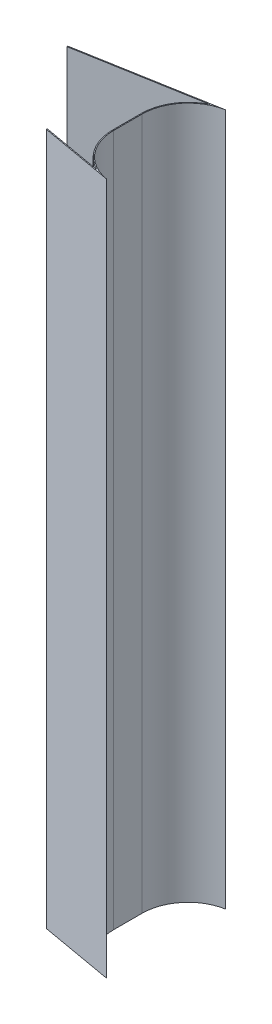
ISO-10303-21;
HEADER;
FILE_DESCRIPTION(('STEP AP214'),'2;1');
FILE_NAME('part.step','',(''),(''),'','','');
FILE_SCHEMA(('AUTOMOTIVE_DESIGN { 1 0 10303 214 1 1 1 1 }'));
ENDSEC;
DATA;
#1=APPLICATION_CONTEXT('core data for automotive mechanical design processes');
#2=APPLICATION_PROTOCOL_DEFINITION('international standard','automotive_design',2000,#1);
#3=PRODUCT_CONTEXT('',#1,'mechanical');
#4=PRODUCT('Part','Part','',(#3));
#5=PRODUCT_RELATED_PRODUCT_CATEGORY('part','',(#4));
#6=PRODUCT_DEFINITION_FORMATION('','',#4);
#7=PRODUCT_DEFINITION_CONTEXT('part definition',#1,'design');
#8=PRODUCT_DEFINITION('design','',#6,#7);
#9=PRODUCT_DEFINITION_SHAPE('','',#8);
#10=(LENGTH_UNIT() NAMED_UNIT(*) SI_UNIT(.MILLI.,.METRE.));
#11=(NAMED_UNIT(*) PLANE_ANGLE_UNIT() SI_UNIT($,.RADIAN.));
#12=(NAMED_UNIT(*) SI_UNIT($,.STERADIAN.) SOLID_ANGLE_UNIT());
#13=UNCERTAINTY_MEASURE_WITH_UNIT(LENGTH_MEASURE(1.E-05),#10,'distance_accuracy_value','');
#14=(GEOMETRIC_REPRESENTATION_CONTEXT(3) GLOBAL_UNCERTAINTY_ASSIGNED_CONTEXT((#13)) GLOBAL_UNIT_ASSIGNED_CONTEXT((#10,
#11,#12)) REPRESENTATION_CONTEXT('',''));
#15=CARTESIAN_POINT('',(0.,0.,0.));
#16=DIRECTION('',(0.,0.,1.));
#17=DIRECTION('',(1.,0.,0.));
#18=AXIS2_PLACEMENT_3D('',#15,#16,#17);
#19=CARTESIAN_POINT('',(-83.0844841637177,762.,50.2758972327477));
#20=DIRECTION('',(0.984807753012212,0.,0.173648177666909));
#21=DIRECTION('',(0.173648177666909,0.,-0.984807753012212));
#22=AXIS2_PLACEMENT_3D('',#19,#20,#21);
#23=PLANE('',#22);
#24=DIRECTION('',(-0.173648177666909,0.,0.984807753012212));
#25=VECTOR('',#24,1.);
#26=CARTESIAN_POINT('',(-83.0844841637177,0.,50.2758972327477));
#27=LINE('',#26,#25);
#28=CARTESIAN_POINT('',(-82.9080576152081,0.,49.2753325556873));
#29=VERTEX_POINT('',#28);
#30=CARTESIAN_POINT('',(-83.0844841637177,0.,50.2758972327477));
#31=VERTEX_POINT('',#30);
#32=EDGE_CURVE('E154',#29,#31,#27,.T.);
#33=ORIENTED_EDGE('',*,*,#32,.T.);
#34=DIRECTION('',(0.,-1.,0.));
#35=VECTOR('',#34,1.);
#36=CARTESIAN_POINT('',(-83.0844841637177,762.,50.2758972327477));
#37=LINE('',#36,#35);
#38=CARTESIAN_POINT('',(-83.0844841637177,762.,50.2758972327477));
#39=VERTEX_POINT('',#38);
#40=EDGE_CURVE('E11',#39,#31,#37,.T.);
#41=ORIENTED_EDGE('',*,*,#40,.F.);
#42=DIRECTION('',(-0.173648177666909,0.,0.984807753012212));
#43=VECTOR('',#42,1.);
#44=CARTESIAN_POINT('',(-83.0844841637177,762.,50.2758972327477));
#45=LINE('',#44,#43);
#46=CARTESIAN_POINT('',(-82.9080576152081,762.,49.2753325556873));
#47=VERTEX_POINT('',#46);
#48=EDGE_CURVE('E176',#47,#39,#45,.T.);
#49=ORIENTED_EDGE('',*,*,#48,.F.);
#50=DIRECTION('',(0.,-1.,0.));
#51=VECTOR('',#50,1.);
#52=CARTESIAN_POINT('',(-82.9080576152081,762.,49.2753325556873));
#53=LINE('',#52,#51);
#54=EDGE_CURVE('E150',#47,#29,#53,.T.);
#55=ORIENTED_EDGE('',*,*,#54,.T.);
#56=EDGE_LOOP('',(#33,#41,#49,#55));
#57=FACE_BOUND('',#56,.T.);
#58=ADVANCED_FACE('F34',(#57),#23,.F.);
#59=CARTESIAN_POINT('',(-83.0844841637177,762.,50.2758972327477));
#60=DIRECTION('',(0.173648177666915,0.,-0.984807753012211));
#61=DIRECTION('',(-0.984807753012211,0.,-0.173648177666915));
#62=AXIS2_PLACEMENT_3D('',#59,#60,#61);
#63=PLANE('',#62);
#64=DIRECTION('',(0.984807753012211,0.,0.173648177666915));
#65=VECTOR('',#64,1.);
#66=CARTESIAN_POINT('',(-83.0844841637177,0.,50.2758972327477));
#67=LINE('',#66,#65);
#68=CARTESIAN_POINT('',(-3.00472742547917,0.,64.3961189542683));
#69=VERTEX_POINT('',#68);
#70=EDGE_CURVE('E157',#31,#69,#67,.T.);
#71=ORIENTED_EDGE('',*,*,#70,.T.);
#72=DIRECTION('',(0.,-1.,0.));
#73=VECTOR('',#72,1.);
#74=CARTESIAN_POINT('',(-3.00472742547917,762.,64.3961189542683));
#75=LINE('',#74,#73);
#76=CARTESIAN_POINT('',(-3.00472742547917,762.,64.3961189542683));
#77=VERTEX_POINT('',#76);
#78=EDGE_CURVE('E42',#77,#69,#75,.T.);
#79=ORIENTED_EDGE('',*,*,#78,.F.);
#80=DIRECTION('',(0.984807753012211,0.,0.173648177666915));
#81=VECTOR('',#80,1.);
#82=CARTESIAN_POINT('',(-83.0844841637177,762.,50.2758972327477));
#83=LINE('',#82,#81);
#84=EDGE_CURVE('E105',#39,#77,#83,.T.);
#85=ORIENTED_EDGE('',*,*,#84,.F.);
#86=ORIENTED_EDGE('',*,*,#40,.T.);
#87=EDGE_LOOP('',(#71,#79,#85,#86));
#88=FACE_BOUND('',#87,.T.);
#89=ADVANCED_FACE('F254',(#88),#63,.F.);
#90=CARTESIAN_POINT('',(5.81659999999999,762.,14.367885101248));
#91=DIRECTION('',(0.,-1.,0.));
#92=DIRECTION('',(0.,0.,-1.));
#93=AXIS2_PLACEMENT_3D('',#90,#91,#92);
#94=CYLINDRICAL_SURFACE('',#93,50.8);
#95=CARTESIAN_POINT('',(5.81659999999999,0.,14.367885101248));
#96=DIRECTION('',(0.,-1.,0.));
#97=DIRECTION('',(0.,0.,-1.));
#98=AXIS2_PLACEMENT_3D('',#95,#96,#97);
#99=CIRCLE('',#98,50.8);
#100=CARTESIAN_POINT('',(-44.9834,0.,14.367885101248));
#101=VERTEX_POINT('',#100);
#102=EDGE_CURVE('E159',#69,#101,#99,.T.);
#103=ORIENTED_EDGE('',*,*,#102,.T.);
#104=DIRECTION('',(0.,-1.,0.));
#105=VECTOR('',#104,1.);
#106=CARTESIAN_POINT('',(-44.9834,762.,14.367885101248));
#107=LINE('',#106,#105);
#108=CARTESIAN_POINT('',(-44.9834,762.,14.367885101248));
#109=VERTEX_POINT('',#108);
#110=EDGE_CURVE('E195',#109,#101,#107,.T.);
#111=ORIENTED_EDGE('',*,*,#110,.F.);
#112=CARTESIAN_POINT('',(5.81659999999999,762.,14.367885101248));
#113=DIRECTION('',(0.,-1.,0.));
#114=DIRECTION('',(0.,0.,-1.));
#115=AXIS2_PLACEMENT_3D('',#112,#113,#114);
#116=CIRCLE('',#115,50.8);
#117=EDGE_CURVE('E203',#77,#109,#116,.T.);
#118=ORIENTED_EDGE('',*,*,#117,.F.);
#119=ORIENTED_EDGE('',*,*,#78,.T.);
#120=EDGE_LOOP('',(#103,#111,#118,#119));
#121=FACE_BOUND('',#120,.T.);
#122=ADVANCED_FACE('F201',(#121),#94,.F.);
#123=CARTESIAN_POINT('',(-44.9834,762.,14.367885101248));
#124=DIRECTION('',(-1.,0.,0.));
#125=DIRECTION('',(0.,0.,1.));
#126=AXIS2_PLACEMENT_3D('',#123,#124,#125);
#127=PLANE('',#126);
#128=DIRECTION('',(0.,0.,-1.));
#129=VECTOR('',#128,1.);
#130=CARTESIAN_POINT('',(-44.9834,0.,14.367885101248));
#131=LINE('',#130,#129);
#132=CARTESIAN_POINT('',(-44.9834,0.,-16.9468876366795));
#133=VERTEX_POINT('',#132);
#134=EDGE_CURVE('E161',#101,#133,#131,.T.);
#135=ORIENTED_EDGE('',*,*,#134,.T.);
#136=DIRECTION('',(0.,-1.,0.));
#137=VECTOR('',#136,1.);
#138=CARTESIAN_POINT('',(-44.9834,762.,-16.9468876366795));
#139=LINE('',#138,#137);
#140=CARTESIAN_POINT('',(-44.9834,762.,-16.9468876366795));
#141=VERTEX_POINT('',#140);
#142=EDGE_CURVE('E192',#141,#133,#139,.T.);
#143=ORIENTED_EDGE('',*,*,#142,.F.);
#144=DIRECTION('',(0.,0.,-1.));
#145=VECTOR('',#144,1.);
#146=CARTESIAN_POINT('',(-44.9834,762.,14.367885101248));
#147=LINE('',#146,#145);
#148=EDGE_CURVE('E221',#109,#141,#147,.T.);
#149=ORIENTED_EDGE('',*,*,#148,.F.);
#150=ORIENTED_EDGE('',*,*,#110,.T.);
#151=EDGE_LOOP('',(#135,#143,#149,#150));
#152=FACE_BOUND('',#151,.T.);
#153=ADVANCED_FACE('F212',(#152),#127,.F.);
#154=CARTESIAN_POINT('',(5.81659999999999,762.,-16.9468876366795));
#155=DIRECTION('',(0.,-1.,0.));
#156=DIRECTION('',(0.,0.,-1.));
#157=AXIS2_PLACEMENT_3D('',#154,#155,#156);
#158=CYLINDRICAL_SURFACE('',#157,50.8);
#159=CARTESIAN_POINT('',(5.81659999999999,0.,-16.9468876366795));
#160=DIRECTION('',(0.,-1.,0.));
#161=DIRECTION('',(0.,0.,-1.));
#162=AXIS2_PLACEMENT_3D('',#159,#160,#161);
#163=CIRCLE('',#162,50.8);
#164=CARTESIAN_POINT('',(-3.00472742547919,0.,-66.9751214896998));
#165=VERTEX_POINT('',#164);
#166=EDGE_CURVE('E163',#133,#165,#163,.T.);
#167=ORIENTED_EDGE('',*,*,#166,.T.);
#168=DIRECTION('',(0.,-1.,0.));
#169=VECTOR('',#168,1.);
#170=CARTESIAN_POINT('',(-3.00472742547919,762.,-66.9751214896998));
#171=LINE('',#170,#169);
#172=CARTESIAN_POINT('',(-3.00472742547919,762.,-66.9751214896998));
#173=VERTEX_POINT('',#172);
#174=EDGE_CURVE('E189',#173,#165,#171,.T.);
#175=ORIENTED_EDGE('',*,*,#174,.F.);
#176=CARTESIAN_POINT('',(5.81659999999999,762.,-16.9468876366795));
#177=DIRECTION('',(0.,-1.,0.));
#178=DIRECTION('',(0.,0.,-1.));
#179=AXIS2_PLACEMENT_3D('',#176,#177,#178);
#180=CIRCLE('',#179,50.8);
#181=EDGE_CURVE('E218',#141,#173,#180,.T.);
#182=ORIENTED_EDGE('',*,*,#181,.F.);
#183=ORIENTED_EDGE('',*,*,#142,.T.);
#184=EDGE_LOOP('',(#167,#175,#182,#183));
#185=FACE_BOUND('',#184,.T.);
#186=ADVANCED_FACE('F216',(#185),#158,.F.);
#187=CARTESIAN_POINT('',(-3.00472742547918,762.,-66.9751214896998));
#188=DIRECTION('',(0.173648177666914,0.,0.984807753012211));
#189=DIRECTION('',(0.984807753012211,0.,-0.173648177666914));
#190=AXIS2_PLACEMENT_3D('',#187,#188,#189);
#191=PLANE('',#190);
#192=DIRECTION('',(-0.984807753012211,0.,0.173648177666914));
#193=VECTOR('',#192,1.);
#194=CARTESIAN_POINT('',(-3.00472742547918,0.,-66.9751214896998));
#195=LINE('',#194,#193);
#196=CARTESIAN_POINT('',(-150.87680958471,0.,-40.9012837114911));
#197=VERTEX_POINT('',#196);
#198=EDGE_CURVE('E165',#165,#197,#195,.T.);
#199=ORIENTED_EDGE('',*,*,#198,.T.);
#200=DIRECTION('',(0.,-1.,0.));
#201=VECTOR('',#200,1.);
#202=CARTESIAN_POINT('',(-150.87680958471,762.,-40.9012837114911));
#203=LINE('',#202,#201);
#204=CARTESIAN_POINT('',(-150.87680958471,762.,-40.9012837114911));
#205=VERTEX_POINT('',#204);
#206=EDGE_CURVE('E186',#205,#197,#203,.T.);
#207=ORIENTED_EDGE('',*,*,#206,.F.);
#208=DIRECTION('',(-0.984807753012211,0.,0.173648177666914));
#209=VECTOR('',#208,1.);
#210=CARTESIAN_POINT('',(-3.00472742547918,762.,-66.9751214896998));
#211=LINE('',#210,#209);
#212=EDGE_CURVE('E220',#173,#205,#211,.T.);
#213=ORIENTED_EDGE('',*,*,#212,.F.);
#214=ORIENTED_EDGE('',*,*,#174,.T.);
#215=EDGE_LOOP('',(#199,#207,#213,#214));
#216=FACE_BOUND('',#215,.T.);
#217=ADVANCED_FACE('F267',(#216),#191,.F.);
#218=CARTESIAN_POINT('',(-150.700383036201,762.,-39.9007190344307));
#219=DIRECTION('',(0.984807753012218,0.,-0.173648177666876));
#220=DIRECTION('',(-0.173648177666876,0.,-0.984807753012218));
#221=AXIS2_PLACEMENT_3D('',#218,#219,#220);
#222=PLANE('',#221);
#223=DIRECTION('',(0.173648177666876,0.,0.984807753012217));
#224=VECTOR('',#223,1.);
#225=CARTESIAN_POINT('',(-150.700383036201,0.,-39.9007190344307));
#226=LINE('',#225,#224);
#227=CARTESIAN_POINT('',(-150.700383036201,0.,-39.9007190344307));
#228=VERTEX_POINT('',#227);
#229=EDGE_CURVE('E167',#197,#228,#226,.T.);
#230=ORIENTED_EDGE('',*,*,#229,.T.);
#231=DIRECTION('',(0.,-1.,0.));
#232=VECTOR('',#231,1.);
#233=CARTESIAN_POINT('',(-150.700383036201,762.,-39.9007190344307));
#234=LINE('',#233,#232);
#235=CARTESIAN_POINT('',(-150.700383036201,762.,-39.9007190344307));
#236=VERTEX_POINT('',#235);
#237=EDGE_CURVE('E183',#236,#228,#234,.T.);
#238=ORIENTED_EDGE('',*,*,#237,.F.);
#239=DIRECTION('',(0.173648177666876,0.,0.984807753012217));
#240=VECTOR('',#239,1.);
#241=CARTESIAN_POINT('',(-150.700383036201,762.,-39.9007190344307));
#242=LINE('',#241,#240);
#243=EDGE_CURVE('E223',#205,#236,#242,.T.);
#244=ORIENTED_EDGE('',*,*,#243,.F.);
#245=ORIENTED_EDGE('',*,*,#206,.T.);
#246=EDGE_LOOP('',(#230,#238,#244,#245));
#247=FACE_BOUND('',#246,.T.);
#248=ADVANCED_FACE('F270',(#247),#222,.F.);
#249=CARTESIAN_POINT('',(-16.9784222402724,762.,-63.4795086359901));
#250=DIRECTION('',(-0.173648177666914,0.,-0.984807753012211));
#251=DIRECTION('',(-0.984807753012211,0.,0.173648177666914));
#252=AXIS2_PLACEMENT_3D('',#249,#250,#251);
#253=PLANE('',#252);
#254=DIRECTION('',(0.984807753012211,0.,-0.173648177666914));
#255=VECTOR('',#254,1.);
#256=CARTESIAN_POINT('',(-16.9784222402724,0.,-63.4795086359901));
#257=LINE('',#256,#255);
#258=CARTESIAN_POINT('',(-16.9784222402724,0.,-63.4795086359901));
#259=VERTEX_POINT('',#258);
#260=EDGE_CURVE('E169',#228,#259,#257,.T.);
#261=ORIENTED_EDGE('',*,*,#260,.T.);
#262=DIRECTION('',(0.,-1.,0.));
#263=VECTOR('',#262,1.);
#264=CARTESIAN_POINT('',(-16.9784222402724,762.,-63.4795086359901));
#265=LINE('',#264,#263);
#266=CARTESIAN_POINT('',(-16.9784222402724,762.,-63.4795086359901));
#267=VERTEX_POINT('',#266);
#268=EDGE_CURVE('E180',#267,#259,#265,.T.);
#269=ORIENTED_EDGE('',*,*,#268,.F.);
#270=DIRECTION('',(0.984807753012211,0.,-0.173648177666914));
#271=VECTOR('',#270,1.);
#272=CARTESIAN_POINT('',(-16.9784222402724,762.,-63.4795086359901));
#273=LINE('',#272,#271);
#274=EDGE_CURVE('E229',#236,#267,#273,.T.);
#275=ORIENTED_EDGE('',*,*,#274,.F.);
#276=ORIENTED_EDGE('',*,*,#237,.T.);
#277=EDGE_LOOP('',(#261,#269,#275,#276));
#278=FACE_BOUND('',#277,.T.);
#279=ADVANCED_FACE('F235',(#278),#253,.F.);
#280=CARTESIAN_POINT('',(5.81659999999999,762.,-16.9468876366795));
#281=DIRECTION('',(0.,-1.,0.));
#282=DIRECTION('',(0.,0.,-1.));
#283=AXIS2_PLACEMENT_3D('',#280,#281,#282);
#284=CYLINDRICAL_SURFACE('',#283,51.816);
#285=CARTESIAN_POINT('',(5.81659999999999,0.,-16.9468876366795));
#286=DIRECTION('',(0.,1.,0.));
#287=DIRECTION('',(0.,0.,-1.));
#288=AXIS2_PLACEMENT_3D('',#285,#286,#287);
#289=CIRCLE('',#288,51.816);
#290=CARTESIAN_POINT('',(-45.9994,0.,-16.9468876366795));
#291=VERTEX_POINT('',#290);
#292=EDGE_CURVE('E171',#259,#291,#289,.T.);
#293=ORIENTED_EDGE('',*,*,#292,.T.);
#294=DIRECTION('',(0.,-1.,0.));
#295=VECTOR('',#294,1.);
#296=CARTESIAN_POINT('',(-45.9994,762.,-16.9468876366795));
#297=LINE('',#296,#295);
#298=CARTESIAN_POINT('',(-45.9994,762.,-16.9468876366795));
#299=VERTEX_POINT('',#298);
#300=EDGE_CURVE('E145',#299,#291,#297,.T.);
#301=ORIENTED_EDGE('',*,*,#300,.F.);
#302=CARTESIAN_POINT('',(5.81659999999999,762.,-16.9468876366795));
#303=DIRECTION('',(0.,1.,0.));
#304=DIRECTION('',(0.,0.,-1.));
#305=AXIS2_PLACEMENT_3D('',#302,#303,#304);
#306=CIRCLE('',#305,51.816);
#307=EDGE_CURVE('E136',#267,#299,#306,.T.);
#308=ORIENTED_EDGE('',*,*,#307,.F.);
#309=ORIENTED_EDGE('',*,*,#268,.T.);
#310=EDGE_LOOP('',(#293,#301,#308,#309));
#311=FACE_BOUND('',#310,.T.);
#312=ADVANCED_FACE('F239',(#311),#284,.T.);
#313=CARTESIAN_POINT('',(-45.9994,762.,14.367885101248));
#314=DIRECTION('',(1.,0.,0.));
#315=DIRECTION('',(0.,0.,-1.));
#316=AXIS2_PLACEMENT_3D('',#313,#314,#315);
#317=PLANE('',#316);
#318=DIRECTION('',(0.,0.,1.));
#319=VECTOR('',#318,1.);
#320=CARTESIAN_POINT('',(-45.9994,0.,14.367885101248));
#321=LINE('',#320,#319);
#322=CARTESIAN_POINT('',(-45.9994,0.,14.367885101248));
#323=VERTEX_POINT('',#322);
#324=EDGE_CURVE('E144',#291,#323,#321,.T.);
#325=ORIENTED_EDGE('',*,*,#324,.T.);
#326=DIRECTION('',(0.,-1.,0.));
#327=VECTOR('',#326,1.);
#328=CARTESIAN_POINT('',(-45.9994,762.,14.367885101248));
#329=LINE('',#328,#327);
#330=CARTESIAN_POINT('',(-45.9994,762.,14.367885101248));
#331=VERTEX_POINT('',#330);
#332=EDGE_CURVE('E141',#331,#323,#329,.T.);
#333=ORIENTED_EDGE('',*,*,#332,.F.);
#334=DIRECTION('',(0.,0.,1.));
#335=VECTOR('',#334,1.);
#336=CARTESIAN_POINT('',(-45.9994,762.,14.367885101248));
#337=LINE('',#336,#335);
#338=EDGE_CURVE('E130',#299,#331,#337,.T.);
#339=ORIENTED_EDGE('',*,*,#338,.F.);
#340=ORIENTED_EDGE('',*,*,#300,.T.);
#341=EDGE_LOOP('',(#325,#333,#339,#340));
#342=FACE_BOUND('',#341,.T.);
#343=ADVANCED_FACE('F142',(#342),#317,.F.);
#344=CARTESIAN_POINT('',(5.81659999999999,762.,14.367885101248));
#345=DIRECTION('',(0.,-1.,0.));
#346=DIRECTION('',(0.,0.,-1.));
#347=AXIS2_PLACEMENT_3D('',#344,#345,#346);
#348=CYLINDRICAL_SURFACE('',#347,51.816);
#349=CARTESIAN_POINT('',(5.81659999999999,0.,14.367885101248));
#350=DIRECTION('',(0.,1.,0.));
#351=DIRECTION('',(0.,0.,-1.));
#352=AXIS2_PLACEMENT_3D('',#349,#350,#351);
#353=CIRCLE('',#352,51.816);
#354=CARTESIAN_POINT('',(-16.9784222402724,0.,60.9005061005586));
#355=VERTEX_POINT('',#354);
#356=EDGE_CURVE('E91',#323,#355,#353,.T.);
#357=ORIENTED_EDGE('',*,*,#356,.T.);
#358=DIRECTION('',(0.,-1.,0.));
#359=VECTOR('',#358,1.);
#360=CARTESIAN_POINT('',(-16.9784222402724,762.,60.9005061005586));
#361=LINE('',#360,#359);
#362=CARTESIAN_POINT('',(-16.9784222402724,762.,60.9005061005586));
#363=VERTEX_POINT('',#362);
#364=EDGE_CURVE('E146',#363,#355,#361,.T.);
#365=ORIENTED_EDGE('',*,*,#364,.F.);
#366=CARTESIAN_POINT('',(5.81659999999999,762.,14.367885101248));
#367=DIRECTION('',(0.,1.,0.));
#368=DIRECTION('',(0.,0.,-1.));
#369=AXIS2_PLACEMENT_3D('',#366,#367,#368);
#370=CIRCLE('',#369,51.816);
#371=EDGE_CURVE('E134',#331,#363,#370,.T.);
#372=ORIENTED_EDGE('',*,*,#371,.F.);
#373=ORIENTED_EDGE('',*,*,#332,.T.);
#374=EDGE_LOOP('',(#357,#365,#372,#373));
#375=FACE_BOUND('',#374,.T.);
#376=ADVANCED_FACE('F148',(#375),#348,.T.);
#377=CARTESIAN_POINT('',(-82.9080576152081,762.,49.2753325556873));
#378=DIRECTION('',(-0.173648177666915,0.,0.984807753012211));
#379=DIRECTION('',(0.984807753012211,0.,0.173648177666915));
#380=AXIS2_PLACEMENT_3D('',#377,#378,#379);
#381=PLANE('',#380);
#382=DIRECTION('',(-0.984807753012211,0.,-0.173648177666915));
#383=VECTOR('',#382,1.);
#384=CARTESIAN_POINT('',(-82.9080576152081,0.,49.2753325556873));
#385=LINE('',#384,#383);
#386=EDGE_CURVE('E97',#355,#29,#385,.T.);
#387=ORIENTED_EDGE('',*,*,#386,.T.);
#388=ORIENTED_EDGE('',*,*,#54,.F.);
#389=DIRECTION('',(-0.984807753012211,0.,-0.173648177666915));
#390=VECTOR('',#389,1.);
#391=CARTESIAN_POINT('',(-82.9080576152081,762.,49.2753325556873));
#392=LINE('',#391,#390);
#393=EDGE_CURVE('E50',#363,#47,#392,.T.);
#394=ORIENTED_EDGE('',*,*,#393,.F.);
#395=ORIENTED_EDGE('',*,*,#364,.T.);
#396=EDGE_LOOP('',(#387,#388,#394,#395));
#397=FACE_BOUND('',#396,.T.);
#398=ADVANCED_FACE('F243',(#397),#381,.F.);
#399=CARTESIAN_POINT('',(5.81659999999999,762.,14.367885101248));
#400=DIRECTION('',(0.,-1.,0.));
#401=DIRECTION('',(0.,0.,-1.));
#402=AXIS2_PLACEMENT_3D('',#399,#400,#401);
#403=PLANE('',#402);
#404=ORIENTED_EDGE('',*,*,#48,.T.);
#405=ORIENTED_EDGE('',*,*,#84,.T.);
#406=ORIENTED_EDGE('',*,*,#117,.T.);
#407=ORIENTED_EDGE('',*,*,#148,.T.);
#408=ORIENTED_EDGE('',*,*,#181,.T.);
#409=ORIENTED_EDGE('',*,*,#212,.T.);
#410=ORIENTED_EDGE('',*,*,#243,.T.);
#411=ORIENTED_EDGE('',*,*,#274,.T.);
#412=ORIENTED_EDGE('',*,*,#307,.T.);
#413=ORIENTED_EDGE('',*,*,#338,.T.);
#414=ORIENTED_EDGE('',*,*,#371,.T.);
#415=ORIENTED_EDGE('',*,*,#393,.T.);
#416=EDGE_LOOP('',(#404,#405,#406,#407,#408,#409,#410,#411,#412,#413,#414,#415));
#417=FACE_BOUND('',#416,.T.);
#418=ADVANCED_FACE('F132',(#417),#403,.F.);
#419=CARTESIAN_POINT('',(5.81659999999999,0.,14.367885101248));
#420=DIRECTION('',(0.,-1.,0.));
#421=DIRECTION('',(0.,0.,-1.));
#422=AXIS2_PLACEMENT_3D('',#419,#420,#421);
#423=PLANE('',#422);
#424=ORIENTED_EDGE('',*,*,#32,.F.);
#425=ORIENTED_EDGE('',*,*,#386,.F.);
#426=ORIENTED_EDGE('',*,*,#356,.F.);
#427=ORIENTED_EDGE('',*,*,#324,.F.);
#428=ORIENTED_EDGE('',*,*,#292,.F.);
#429=ORIENTED_EDGE('',*,*,#260,.F.);
#430=ORIENTED_EDGE('',*,*,#229,.F.);
#431=ORIENTED_EDGE('',*,*,#198,.F.);
#432=ORIENTED_EDGE('',*,*,#166,.F.);
#433=ORIENTED_EDGE('',*,*,#134,.F.);
#434=ORIENTED_EDGE('',*,*,#102,.F.);
#435=ORIENTED_EDGE('',*,*,#70,.F.);
#436=EDGE_LOOP('',(#424,#425,#426,#427,#428,#429,#430,#431,#432,#433,#434,#435));
#437=FACE_BOUND('',#436,.T.);
#438=ADVANCED_FACE('F207',(#437),#423,.T.);
#439=CLOSED_SHELL('',(#58,#89,#122,#153,#186,#217,#248,#279,#312,#343,#376,#398,#418,#438));
#440=MANIFOLD_SOLID_BREP('B2',#439);
#441=ADVANCED_BREP_SHAPE_REPRESENTATION('',(#18,#440),#14);
#442=SHAPE_DEFINITION_REPRESENTATION(#9,#441);
ENDSEC;
END-ISO-10303-21;
